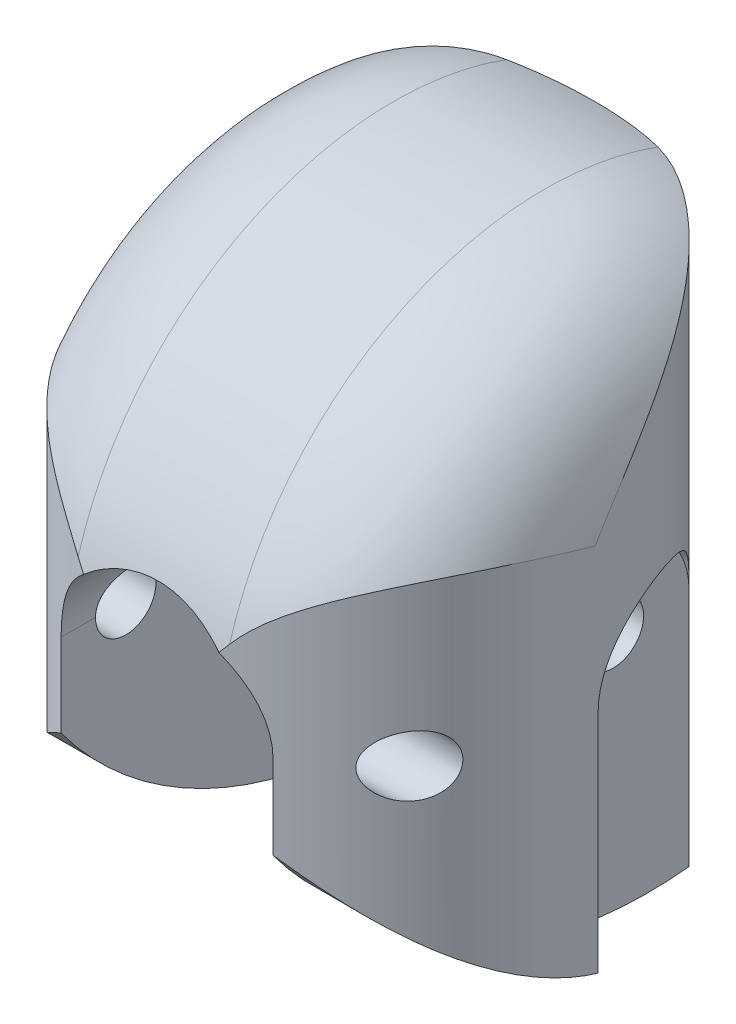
from build123d import *

# Parameters (mm, degrees)
AUFSATZ_LINEAR_AUSTRAGEN3_DEPTH      = 7.5
DURCHGANGSLOCH_F_R_M32_D             = 3.4
SCHNITT_LINEAR_AUSTRAGEN4_DEPTH      = 2.6
SCHNITT_LINEAR_AUSTRAGEN3_DEPTH      = 19.5
SCHNITT_LINEAR_AUSTRAGEN3_DEPTH_BACK = 4
SCHNITT_LINEAR_AUSTRAGEN3_START      = 3
SCHNITT_LINEAR_AUSTRAGEN6_DEPTH      = 16.161171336
SCHNITT_LINEAR_AUSTRAGEN6_DEPTH_BACK = 16.161171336
VERRUNDUNG1_R                        = 5
SKIZZE31_R                           = 8.535533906
SKIZZE31_R_2                         = 7.5
SCHNITT_LINEAR_AUSTRAGEN7_DEPTH      = 15
SKIZZE32_R                           = 1
SCHNITT_LINEAR_AUSTRAGEN8_DEPTH      = 7.5
KES_EKSTR_ZYON1_DEPTH                = 2
IZIM6_R                              = 1
KES_EKSTR_ZYON11_DEPTH               = 3


with BuildPart() as part:
    # Skizze1 → Rotation6 (revolve)
    with BuildSketch(Plane.XY):
        with BuildLine():
            Line((0, -8), (0, -7))
            Line((0, -7), (0, 7.5))
            ThreePointArc((0, 7.5), (-5.303300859, 5.303300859), (-7.5, 0))
            Line((-7.5, 0), (-7.5, -8))
            Line((-7.5, -8), (0, -8))
        make_face()
    revolve(axis=Axis((0, 0, 0), (0, 1, 0)))

    # Skizze28 → Aufsatz-Linear austragen3 (add, symmetric)
    with BuildSketch(Plane(origin=(0, 0, 0), x_dir=(0, 0, -1), z_dir=(1, 0, 0))):
        with BuildLine():
            Line((-7.5, 0), (7.5, 0))
            Line((7.5, 0), (7.5, 10))
            ThreePointArc((7.5, 10), (-2.675918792, 9.013878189), (-7.5, 0))
        make_face()
    extrude(amount=AUFSATZ_LINEAR_AUSTRAGEN3_DEPTH, both=True)

    # Durchgangsloch f_r M32 (through all)
    with Locations(Plane(origin=(0, 0, 7.5), x_dir=(0, 1, 0), z_dir=(0, 0, 1))):
        with Locations((0, 0)):
            Hole(DURCHGANGSLOCH_F_R_M32_D / 2)

    # Skizze12 → Schnitt-Linear austragen4 (cut)
    with BuildSketch(Plane(origin=(0, 0, -7.5), x_dir=(-1, 0, 0), z_dir=(0, 0, -1))):
        Polygon((3.233161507, 0), (1.616580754, 2.8), (-1.616580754, 2.8), (-3.233161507, 0), (-1.616580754, -2.8), (1.616580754, -2.8), align=None)
    extrude(amount=-SCHNITT_LINEAR_AUSTRAGEN4_DEPTH, mode=Mode.SUBTRACT)

    # Skizze10 → Schnitt-Linear austragen3 (cut, two sides: drawn at the far end of the back side and taken through both)
    with BuildSketch(Plane.XY.offset(SCHNITT_LINEAR_AUSTRAGEN3_START - SCHNITT_LINEAR_AUSTRAGEN3_DEPTH_BACK)):
        with BuildLine():
            Line((-3.5, 0), (-3.5, -11.199457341))
            Line((-3.5, -11.199457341), (3.5, -11.199457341))
            Line((3.5, -11.199457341), (3.5, 0))
            ThreePointArc((3.5, 0), (0, 3.5), (-3.5, 0))
        make_face()
    extrude(amount=SCHNITT_LINEAR_AUSTRAGEN3_DEPTH + SCHNITT_LINEAR_AUSTRAGEN3_DEPTH_BACK, mode=Mode.SUBTRACT)

    # Skizze20 → Schnitt-Linear austragen6 (cut, two sides: drawn at the far end of the back side and taken through both)
    with BuildSketch(Plane(origin=(0, 0, 0), x_dir=(0, 0, -1), z_dir=(1, 0, 0)).offset(-SCHNITT_LINEAR_AUSTRAGEN6_DEPTH_BACK)):
        with BuildLine():
            Line((-6.633249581, -2.741838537), (-6.633249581, -10.502625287))
            Line((-6.633249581, -10.502625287), (7.5, -10.502625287))
            Line((7.5, -10.502625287), (7.5, -7.441838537))
            ThreePointArc((7.5, -7.441838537), (-0.314887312, -7.341919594), (-6.633249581, -2.741838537))
        make_face()
    extrude(amount=SCHNITT_LINEAR_AUSTRAGEN6_DEPTH + SCHNITT_LINEAR_AUSTRAGEN6_DEPTH_BACK, mode=Mode.SUBTRACT)

    # Verrundung1
    verrundung1_edges = [part.edges().sort_by_distance(p)[0] for p in [
        (-7.5, 5, -7.5),
        (7.5, 5, -7.5),
        (7.5, 9.013878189, 2.675918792),
        (-7.5, 9.013878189, 2.675918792),
    ]]
    fillet(verrundung1_edges, radius=VERRUNDUNG1_R)

    # Skizze31 → Schnitt-Linear austragen7 (cut)
    with BuildSketch(Plane(origin=(0, 0, 0), x_dir=(1, 0, 0), z_dir=(0, 1, 0))):
        Circle(SKIZZE31_R)
        Circle(SKIZZE31_R_2, mode=Mode.SUBTRACT)
    extrude(amount=SCHNITT_LINEAR_AUSTRAGEN7_DEPTH, mode=Mode.SUBTRACT)

    # Skizze32 → Schnitt-Linear austragen8 (cut, symmetric)
    with BuildSketch(Plane(origin=(0, 0, 0), x_dir=(0, 0, -1), z_dir=(1, 0, 0))):
        with Locations((-4.5, 0)):
            Circle(SKIZZE32_R)
    extrude(amount=SCHNITT_LINEAR_AUSTRAGEN8_DEPTH, both=True, mode=Mode.SUBTRACT)

    # izim1 → Kes-Ekstr_zyon1 (cut)
    with BuildSketch(Plane(origin=(7.5, 0, 0), x_dir=(0, 0, -1), z_dir=(1, 0, 0))):
        with BuildLine():
            Line((0.1, 0), (0.1, -8.5))
            Line((0.1, -8.5), (5.1, -8.5))
            Line((5.1, -8.5), (5.1, 0))
            ThreePointArc((5.1, 0), (2.6, 2.5), (0.1, 0))
        make_face()
    kes_ekstr_zyon1 = extrude(amount=-KES_EKSTR_ZYON1_DEPTH, mode=Mode.SUBTRACT)

    # izim6 → Kes-Ekstr_zyon11 (cut)
    with BuildSketch(Plane(origin=(5.5, 0, 0), x_dir=(0, 0, -1), z_dir=(1, 0, 0))):
        with Locations((2.6, 0)):
            Circle(IZIM6_R)
    kes_ekstr_zyon11 = extrude(amount=-KES_EKSTR_ZYON11_DEPTH, mode=Mode.SUBTRACT)

    # Aynalama1: Kes-Ekstr_zyon1 across plane
    add(kes_ekstr_zyon1.mirror(Plane(origin=(0, 0, 0), x_dir=(0, 0, 1), z_dir=(1, 0, 0))), mode=Mode.SUBTRACT)

    # Aynalama3: Kes-Ekstr_zyon1, Kes-Ekstr_zyon11 across plane
    add(kes_ekstr_zyon1.mirror(Plane(origin=(0, 0, 0), x_dir=(0, 0, 1), z_dir=(1, 0, 0))), mode=Mode.SUBTRACT)
    add(kes_ekstr_zyon11.mirror(Plane(origin=(0, 0, 0), x_dir=(0, 0, 1), z_dir=(1, 0, 0))), mode=Mode.SUBTRACT)


solid = part.part
